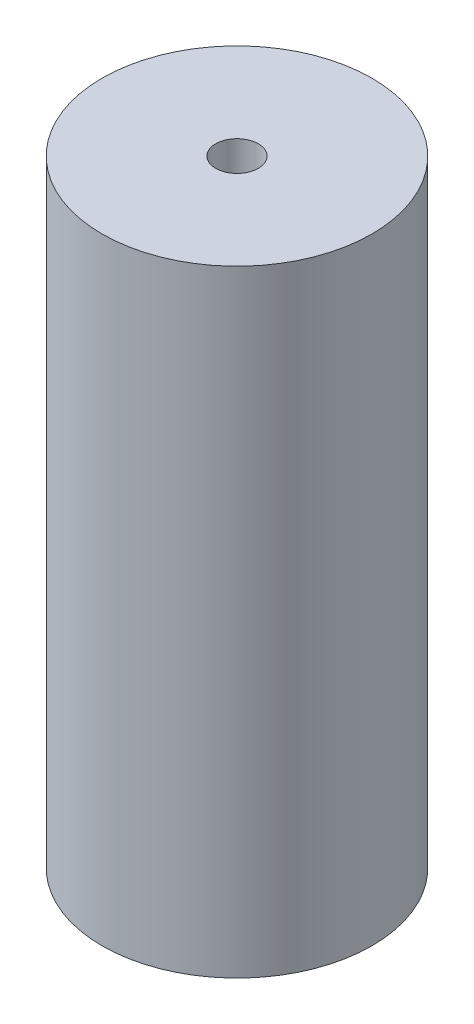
ISO-10303-21;
HEADER;
FILE_DESCRIPTION(('STEP AP214'),'2;1');
FILE_NAME('part.step','',(''),(''),'','','');
FILE_SCHEMA(('AUTOMOTIVE_DESIGN { 1 0 10303 214 1 1 1 1 }'));
ENDSEC;
DATA;
#1=APPLICATION_CONTEXT('core data for automotive mechanical design processes');
#2=APPLICATION_PROTOCOL_DEFINITION('international standard','automotive_design',2000,#1);
#3=PRODUCT_CONTEXT('',#1,'mechanical');
#4=PRODUCT('Part','Part','',(#3));
#5=PRODUCT_RELATED_PRODUCT_CATEGORY('part','',(#4));
#6=PRODUCT_DEFINITION_FORMATION('','',#4);
#7=PRODUCT_DEFINITION_CONTEXT('part definition',#1,'design');
#8=PRODUCT_DEFINITION('design','',#6,#7);
#9=PRODUCT_DEFINITION_SHAPE('','',#8);
#10=(LENGTH_UNIT() NAMED_UNIT(*) SI_UNIT(.MILLI.,.METRE.));
#11=(NAMED_UNIT(*) PLANE_ANGLE_UNIT() SI_UNIT($,.RADIAN.));
#12=(NAMED_UNIT(*) SI_UNIT($,.STERADIAN.) SOLID_ANGLE_UNIT());
#13=UNCERTAINTY_MEASURE_WITH_UNIT(LENGTH_MEASURE(1.E-05),#10,'distance_accuracy_value','');
#14=(GEOMETRIC_REPRESENTATION_CONTEXT(3) GLOBAL_UNCERTAINTY_ASSIGNED_CONTEXT((#13)) GLOBAL_UNIT_ASSIGNED_CONTEXT((#10,
#11,#12)) REPRESENTATION_CONTEXT('',''));
#15=CARTESIAN_POINT('',(0.,0.,0.));
#16=DIRECTION('',(0.,0.,1.));
#17=DIRECTION('',(1.,0.,0.));
#18=AXIS2_PLACEMENT_3D('',#15,#16,#17);
#19=CARTESIAN_POINT('',(0.,21.7,1.50000000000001));
#20=DIRECTION('',(0.,-1.,0.));
#21=DIRECTION('',(0.,0.,-1.));
#22=AXIS2_PLACEMENT_3D('',#19,#20,#21);
#23=PLANE('',#22);
#24=CARTESIAN_POINT('',(0.,21.7,0.));
#25=DIRECTION('',(0.,-1.,0.));
#26=DIRECTION('',(0.,0.,-1.));
#27=AXIS2_PLACEMENT_3D('',#24,#25,#26);
#28=CIRCLE('',#27,9.50000000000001);
#29=CARTESIAN_POINT('',(0.,21.7,-9.50000000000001));
#30=VERTEX_POINT('',#29);
#31=EDGE_CURVE('E10',#30,#30,#28,.T.);
#32=ORIENTED_EDGE('',*,*,#31,.F.);
#33=EDGE_LOOP('',(#32));
#34=FACE_BOUND('',#33,.T.);
#35=CARTESIAN_POINT('',(0.,21.7,0.));
#36=DIRECTION('',(0.,-1.,0.));
#37=DIRECTION('',(0.,0.,-1.));
#38=AXIS2_PLACEMENT_3D('',#35,#36,#37);
#39=CIRCLE('',#38,1.50000000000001);
#40=CARTESIAN_POINT('',(0.,21.7,-1.50000000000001));
#41=VERTEX_POINT('',#40);
#42=EDGE_CURVE('E44',#41,#41,#39,.T.);
#43=ORIENTED_EDGE('',*,*,#42,.T.);
#44=EDGE_LOOP('',(#43));
#45=FACE_BOUND('',#44,.T.);
#46=ADVANCED_FACE('F30',(#34,#45),#23,.F.);
#47=CARTESIAN_POINT('',(0.,-50.,0.));
#48=DIRECTION('',(0.,-1.,0.));
#49=DIRECTION('',(0.,0.,-1.));
#50=AXIS2_PLACEMENT_3D('',#47,#48,#49);
#51=CYLINDRICAL_SURFACE('',#50,9.5);
#52=CARTESIAN_POINT('',(0.,-21.7,0.));
#53=DIRECTION('',(0.,-1.,0.));
#54=DIRECTION('',(0.,0.,-1.));
#55=AXIS2_PLACEMENT_3D('',#52,#53,#54);
#56=CIRCLE('',#55,9.49999999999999);
#57=CARTESIAN_POINT('',(0.,-21.7,-9.49999999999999));
#58=VERTEX_POINT('',#57);
#59=EDGE_CURVE('E36',#58,#58,#56,.T.);
#60=ORIENTED_EDGE('',*,*,#59,.F.);
#61=EDGE_LOOP('',(#60));
#62=FACE_BOUND('',#61,.T.);
#63=ORIENTED_EDGE('',*,*,#31,.T.);
#64=EDGE_LOOP('',(#63));
#65=FACE_BOUND('',#64,.T.);
#66=ADVANCED_FACE('F59',(#62,#65),#51,.T.);
#67=CARTESIAN_POINT('',(0.,-21.7,1.49999999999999));
#68=DIRECTION('',(0.,1.,0.));
#69=DIRECTION('',(0.,0.,1.));
#70=AXIS2_PLACEMENT_3D('',#67,#68,#69);
#71=PLANE('',#70);
#72=CARTESIAN_POINT('',(0.,-21.7,0.));
#73=DIRECTION('',(0.,-1.,0.));
#74=DIRECTION('',(0.,0.,-1.));
#75=AXIS2_PLACEMENT_3D('',#72,#73,#74);
#76=CIRCLE('',#75,1.49999999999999);
#77=CARTESIAN_POINT('',(0.,-21.7,-1.49999999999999));
#78=VERTEX_POINT('',#77);
#79=EDGE_CURVE('E40',#78,#78,#76,.T.);
#80=ORIENTED_EDGE('',*,*,#79,.F.);
#81=EDGE_LOOP('',(#80));
#82=FACE_BOUND('',#81,.T.);
#83=ORIENTED_EDGE('',*,*,#59,.T.);
#84=EDGE_LOOP('',(#83));
#85=FACE_BOUND('',#84,.T.);
#86=ADVANCED_FACE('F54',(#82,#85),#71,.F.);
#87=CARTESIAN_POINT('',(0.,-50.,0.));
#88=DIRECTION('',(0.,-1.,0.));
#89=DIRECTION('',(0.,0.,-1.));
#90=AXIS2_PLACEMENT_3D('',#87,#88,#89);
#91=CYLINDRICAL_SURFACE('',#90,1.5);
#92=ORIENTED_EDGE('',*,*,#42,.F.);
#93=EDGE_LOOP('',(#92));
#94=FACE_BOUND('',#93,.T.);
#95=ORIENTED_EDGE('',*,*,#79,.T.);
#96=EDGE_LOOP('',(#95));
#97=FACE_BOUND('',#96,.T.);
#98=ADVANCED_FACE('F51',(#94,#97),#91,.F.);
#99=CLOSED_SHELL('',(#46,#66,#86,#98));
#100=MANIFOLD_SOLID_BREP('B2',#99);
#101=ADVANCED_BREP_SHAPE_REPRESENTATION('',(#18,#100),#14);
#102=SHAPE_DEFINITION_REPRESENTATION(#9,#101);
ENDSEC;
END-ISO-10303-21;
